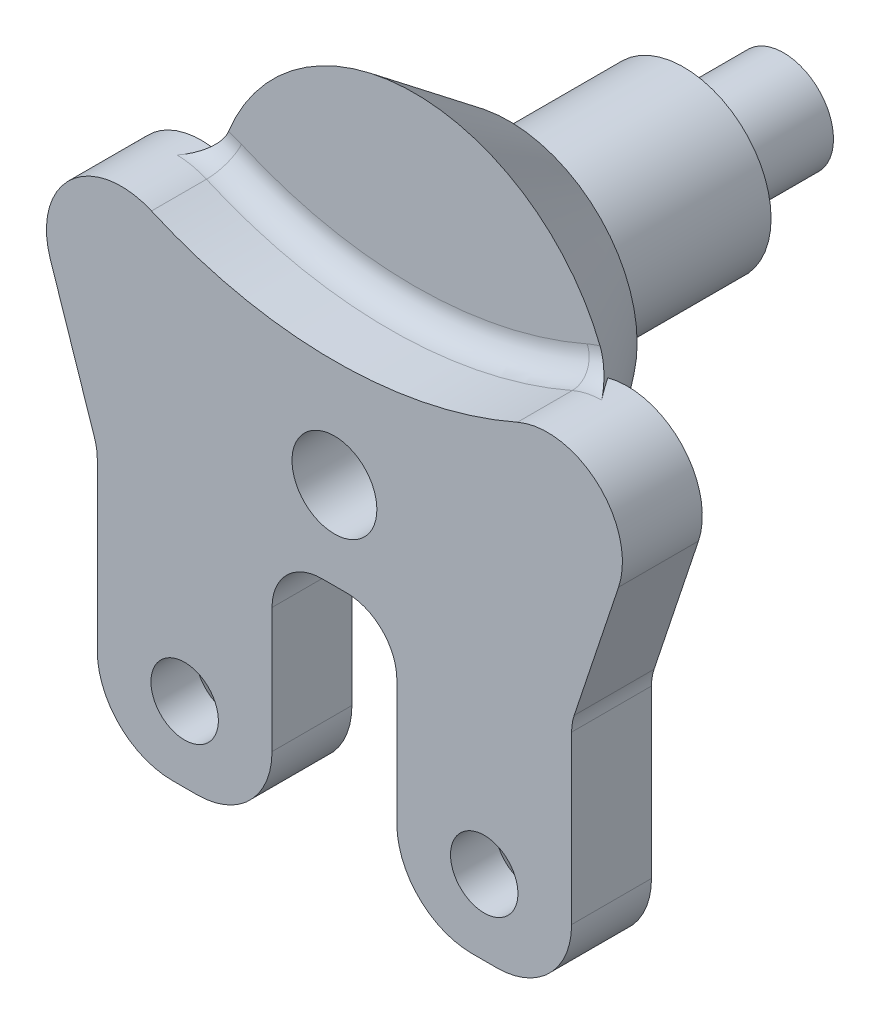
ISO-10303-21;
HEADER;
FILE_DESCRIPTION(('STEP AP214'),'2;1');
FILE_NAME('part.step','',(''),(''),'','','');
FILE_SCHEMA(('AUTOMOTIVE_DESIGN { 1 0 10303 214 1 1 1 1 }'));
ENDSEC;
DATA;
#1=APPLICATION_CONTEXT('core data for automotive mechanical design processes');
#2=APPLICATION_PROTOCOL_DEFINITION('international standard','automotive_design',2000,#1);
#3=PRODUCT_CONTEXT('',#1,'mechanical');
#4=PRODUCT('Part','Part','',(#3));
#5=PRODUCT_RELATED_PRODUCT_CATEGORY('part','',(#4));
#6=PRODUCT_DEFINITION_FORMATION('','',#4);
#7=PRODUCT_DEFINITION_CONTEXT('part definition',#1,'design');
#8=PRODUCT_DEFINITION('design','',#6,#7);
#9=PRODUCT_DEFINITION_SHAPE('','',#8);
#10=(LENGTH_UNIT() NAMED_UNIT(*) SI_UNIT(.MILLI.,.METRE.));
#11=(NAMED_UNIT(*) PLANE_ANGLE_UNIT() SI_UNIT($,.RADIAN.));
#12=(NAMED_UNIT(*) SI_UNIT($,.STERADIAN.) SOLID_ANGLE_UNIT());
#13=UNCERTAINTY_MEASURE_WITH_UNIT(LENGTH_MEASURE(1.E-05),#10,'distance_accuracy_value','');
#14=(GEOMETRIC_REPRESENTATION_CONTEXT(3) GLOBAL_UNCERTAINTY_ASSIGNED_CONTEXT((#13)) GLOBAL_UNIT_ASSIGNED_CONTEXT((#10,
#11,#12)) REPRESENTATION_CONTEXT('',''));
#15=CARTESIAN_POINT('',(0.,0.,0.));
#16=DIRECTION('',(0.,0.,1.));
#17=DIRECTION('',(1.,0.,0.));
#18=AXIS2_PLACEMENT_3D('',#15,#16,#17);
#19=CARTESIAN_POINT('',(8.53571975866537,-0.906007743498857,0.));
#20=DIRECTION('',(0.,0.,1.));
#21=DIRECTION('',(1.,0.,0.));
#22=AXIS2_PLACEMENT_3D('',#19,#20,#21);
#23=PLANE('',#22);
#24=CARTESIAN_POINT('',(0.500000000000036,-9.50000000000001,0.));
#25=DIRECTION('',(0.,0.,-1.));
#26=DIRECTION('',(-1.,0.,0.));
#27=AXIS2_PLACEMENT_3D('',#24,#25,#26);
#28=CIRCLE('',#27,2.);
#29=CARTESIAN_POINT('',(1.6100228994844,-7.83631458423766,0.));
#30=VERTEX_POINT('',#29);
#31=CARTESIAN_POINT('',(2.50000000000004,-9.50000000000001,0.));
#32=VERTEX_POINT('',#31);
#33=EDGE_CURVE('E254',#30,#32,#28,.T.);
#34=ORIENTED_EDGE('',*,*,#33,.F.);
#35=CARTESIAN_POINT('',(0.,0.,0.));
#36=DIRECTION('',(0.,0.,1.));
#37=DIRECTION('',(1.,0.,0.));
#38=AXIS2_PLACEMENT_3D('',#35,#36,#37);
#39=CIRCLE('',#38,8.);
#40=CARTESIAN_POINT('',(7.74881159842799,1.98894917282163,0.));
#41=VERTEX_POINT('',#40);
#42=EDGE_CURVE('E222',#30,#41,#39,.T.);
#43=ORIENTED_EDGE('',*,*,#42,.T.);
#44=CARTESIAN_POINT('',(8.53571975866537,-0.906007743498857,0.));
#45=DIRECTION('',(0.,0.,1.));
#46=DIRECTION('',(1.,0.,0.));
#47=AXIS2_PLACEMENT_3D('',#44,#45,#46);
#48=CIRCLE('',#47,3.);
#49=CARTESIAN_POINT('',(11.3817696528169,-1.85469104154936,0.));
#50=VERTEX_POINT('',#49);
#51=EDGE_CURVE('E229',#50,#41,#48,.T.);
#52=ORIENTED_EDGE('',*,*,#51,.F.);
#53=DIRECTION('',(0.316227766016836,0.948683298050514,0.));
#54=VECTOR('',#53,1.);
#55=CARTESIAN_POINT('',(11.3817696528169,-1.85469104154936,0.));
#56=LINE('',#55,#54);
#57=CARTESIAN_POINT('',(9.60263340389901,-7.19209978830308,0.));
#58=VERTEX_POINT('',#57);
#59=EDGE_CURVE('E270',#58,#50,#56,.T.);
#60=ORIENTED_EDGE('',*,*,#59,.F.);
#61=CARTESIAN_POINT('',(11.5,-7.82455532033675,0.));
#62=DIRECTION('',(0.,0.,-1.));
#63=DIRECTION('',(1.,0.,0.));
#64=AXIS2_PLACEMENT_3D('',#61,#62,#63);
#65=CIRCLE('',#64,2.);
#66=CARTESIAN_POINT('',(9.50000000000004,-7.82455532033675,0.));
#67=VERTEX_POINT('',#66);
#68=EDGE_CURVE('E268',#67,#58,#65,.T.);
#69=ORIENTED_EDGE('',*,*,#68,.F.);
#70=DIRECTION('',(0.,1.,0.));
#71=VECTOR('',#70,1.);
#72=CARTESIAN_POINT('',(9.50000000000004,-7.82455532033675,0.));
#73=LINE('',#72,#71);
#74=CARTESIAN_POINT('',(9.50000000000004,-14.5,0.));
#75=VERTEX_POINT('',#74);
#76=EDGE_CURVE('E266',#75,#67,#73,.T.);
#77=ORIENTED_EDGE('',*,*,#76,.F.);
#78=CARTESIAN_POINT('',(6.50000000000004,-14.5,0.));
#79=DIRECTION('',(0.,0.,1.));
#80=DIRECTION('',(-1.,0.,0.));
#81=AXIS2_PLACEMENT_3D('',#78,#79,#80);
#82=CIRCLE('',#81,3.);
#83=CARTESIAN_POINT('',(6.50000000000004,-17.5,0.));
#84=VERTEX_POINT('',#83);
#85=EDGE_CURVE('E264',#84,#75,#82,.T.);
#86=ORIENTED_EDGE('',*,*,#85,.F.);
#87=DIRECTION('',(1.,0.,0.));
#88=VECTOR('',#87,1.);
#89=CARTESIAN_POINT('',(6.50000000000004,-17.5,0.));
#90=LINE('',#89,#88);
#91=CARTESIAN_POINT('',(5.50000000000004,-17.5,0.));
#92=VERTEX_POINT('',#91);
#93=EDGE_CURVE('E262',#92,#84,#90,.T.);
#94=ORIENTED_EDGE('',*,*,#93,.F.);
#95=CARTESIAN_POINT('',(5.50000000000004,-14.5,0.));
#96=DIRECTION('',(0.,0.,1.));
#97=DIRECTION('',(-1.,0.,0.));
#98=AXIS2_PLACEMENT_3D('',#95,#96,#97);
#99=CIRCLE('',#98,3.);
#100=CARTESIAN_POINT('',(2.50000000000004,-14.5,0.));
#101=VERTEX_POINT('',#100);
#102=EDGE_CURVE('E260',#101,#92,#99,.T.);
#103=ORIENTED_EDGE('',*,*,#102,.F.);
#104=DIRECTION('',(0.,-1.,0.));
#105=VECTOR('',#104,1.);
#106=CARTESIAN_POINT('',(2.50000000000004,-9.50000000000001,0.));
#107=LINE('',#106,#105);
#108=EDGE_CURVE('E258',#32,#101,#107,.T.);
#109=ORIENTED_EDGE('',*,*,#108,.F.);
#110=EDGE_LOOP('',(#34,#43,#52,#60,#69,#77,#86,#94,#103,#109));
#111=FACE_BOUND('',#110,.T.);
#112=CARTESIAN_POINT('',(6.00000000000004,-14.5,0.));
#113=DIRECTION('',(0.,0.,-1.));
#114=DIRECTION('',(-1.,0.,0.));
#115=AXIS2_PLACEMENT_3D('',#112,#113,#114);
#116=CIRCLE('',#115,2.75);
#117=CARTESIAN_POINT('',(3.25000000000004,-14.5,0.));
#118=VERTEX_POINT('',#117);
#119=EDGE_CURVE('E666',#118,#118,#116,.T.);
#120=ORIENTED_EDGE('',*,*,#119,.F.);
#121=EDGE_LOOP('',(#120));
#122=FACE_BOUND('',#121,.T.);
#123=ADVANCED_FACE('F35',(#111,#122),#23,.F.);
#124=CARTESIAN_POINT('',(-8.53571975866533,-0.906007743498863,0.));
#125=DIRECTION('',(0.,0.,1.));
#126=DIRECTION('',(1.,0.,0.));
#127=AXIS2_PLACEMENT_3D('',#124,#125,#126);
#128=CIRCLE('',#127,3.);
#129=CARTESIAN_POINT('',(-7.74881159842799,1.98894917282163,0.));
#130=VERTEX_POINT('',#129);
#131=CARTESIAN_POINT('',(-11.3817696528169,-1.85469104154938,0.));
#132=VERTEX_POINT('',#131);
#133=EDGE_CURVE('E205',#130,#132,#128,.T.);
#134=ORIENTED_EDGE('',*,*,#133,.F.);
#135=CARTESIAN_POINT('',(-1.61002289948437,-7.83631458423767,0.));
#136=VERTEX_POINT('',#135);
#137=EDGE_CURVE('E214',#130,#136,#39,.T.);
#138=ORIENTED_EDGE('',*,*,#137,.T.);
#139=CARTESIAN_POINT('',(-0.5,-9.50000000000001,0.));
#140=DIRECTION('',(0.,0.,-1.));
#141=DIRECTION('',(1.,0.,0.));
#142=AXIS2_PLACEMENT_3D('',#139,#140,#141);
#143=CIRCLE('',#142,2.);
#144=CARTESIAN_POINT('',(-2.5,-9.50000000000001,0.));
#145=VERTEX_POINT('',#144);
#146=EDGE_CURVE('E249',#145,#136,#143,.T.);
#147=ORIENTED_EDGE('',*,*,#146,.F.);
#148=DIRECTION('',(0.,1.,0.));
#149=VECTOR('',#148,1.);
#150=CARTESIAN_POINT('',(-2.5,-9.50000000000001,0.));
#151=LINE('',#150,#149);
#152=CARTESIAN_POINT('',(-2.5,-14.5,0.));
#153=VERTEX_POINT('',#152);
#154=EDGE_CURVE('E246',#153,#145,#151,.T.);
#155=ORIENTED_EDGE('',*,*,#154,.F.);
#156=CARTESIAN_POINT('',(-5.5,-14.5,0.));
#157=DIRECTION('',(0.,0.,1.));
#158=DIRECTION('',(-1.,0.,0.));
#159=AXIS2_PLACEMENT_3D('',#156,#157,#158);
#160=CIRCLE('',#159,3.);
#161=CARTESIAN_POINT('',(-5.5,-17.5,0.));
#162=VERTEX_POINT('',#161);
#163=EDGE_CURVE('E244',#162,#153,#160,.T.);
#164=ORIENTED_EDGE('',*,*,#163,.F.);
#165=DIRECTION('',(1.,0.,0.));
#166=VECTOR('',#165,1.);
#167=CARTESIAN_POINT('',(-5.5,-17.5,0.));
#168=LINE('',#167,#166);
#169=CARTESIAN_POINT('',(-6.5,-17.5,0.));
#170=VERTEX_POINT('',#169);
#171=EDGE_CURVE('E242',#170,#162,#168,.T.);
#172=ORIENTED_EDGE('',*,*,#171,.F.);
#173=CARTESIAN_POINT('',(-6.5,-14.5,0.));
#174=DIRECTION('',(0.,0.,1.));
#175=DIRECTION('',(-1.,0.,0.));
#176=AXIS2_PLACEMENT_3D('',#173,#174,#175);
#177=CIRCLE('',#176,3.);
#178=CARTESIAN_POINT('',(-9.5,-14.5,0.));
#179=VERTEX_POINT('',#178);
#180=EDGE_CURVE('E240',#179,#170,#177,.T.);
#181=ORIENTED_EDGE('',*,*,#180,.F.);
#182=DIRECTION('',(0.,-1.,0.));
#183=VECTOR('',#182,1.);
#184=CARTESIAN_POINT('',(-9.5,-7.82455532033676,0.));
#185=LINE('',#184,#183);
#186=CARTESIAN_POINT('',(-9.5,-7.82455532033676,0.));
#187=VERTEX_POINT('',#186);
#188=EDGE_CURVE('E238',#187,#179,#185,.T.);
#189=ORIENTED_EDGE('',*,*,#188,.F.);
#190=CARTESIAN_POINT('',(-11.5,-7.82455532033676,0.));
#191=DIRECTION('',(0.,0.,-1.));
#192=DIRECTION('',(-1.,0.,0.));
#193=AXIS2_PLACEMENT_3D('',#190,#191,#192);
#194=CIRCLE('',#193,2.);
#195=CARTESIAN_POINT('',(-9.60263340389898,-7.19209978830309,0.));
#196=VERTEX_POINT('',#195);
#197=EDGE_CURVE('E231',#196,#187,#194,.T.);
#198=ORIENTED_EDGE('',*,*,#197,.F.);
#199=DIRECTION('',(0.316227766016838,-0.948683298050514,0.));
#200=VECTOR('',#199,1.);
#201=CARTESIAN_POINT('',(-11.3817696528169,-1.85469104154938,0.));
#202=LINE('',#201,#200);
#203=EDGE_CURVE('E228',#132,#196,#202,.T.);
#204=ORIENTED_EDGE('',*,*,#203,.F.);
#205=EDGE_LOOP('',(#134,#138,#147,#155,#164,#172,#181,#189,#198,#204));
#206=FACE_BOUND('',#205,.T.);
#207=CARTESIAN_POINT('',(-6.,-14.5,0.));
#208=DIRECTION('',(0.,0.,-1.));
#209=DIRECTION('',(-1.,0.,0.));
#210=AXIS2_PLACEMENT_3D('',#207,#208,#209);
#211=CIRCLE('',#210,2.75);
#212=CARTESIAN_POINT('',(-8.75,-14.5,0.));
#213=VERTEX_POINT('',#212);
#214=EDGE_CURVE('E673',#213,#213,#211,.T.);
#215=ORIENTED_EDGE('',*,*,#214,.F.);
#216=EDGE_LOOP('',(#215));
#217=FACE_BOUND('',#216,.T.);
#218=ADVANCED_FACE('F225',(#206,#217),#23,.F.);
#219=CARTESIAN_POINT('',(8.53571975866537,-0.906007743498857,3.2));
#220=DIRECTION('',(0.,0.,1.));
#221=DIRECTION('',(1.,0.,0.));
#222=AXIS2_PLACEMENT_3D('',#219,#220,#221);
#223=PLANE('',#222);
#224=CARTESIAN_POINT('',(6.00000000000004,-14.5,3.2));
#225=DIRECTION('',(0.,0.,-1.));
#226=DIRECTION('',(-1.,0.,0.));
#227=AXIS2_PLACEMENT_3D('',#224,#225,#226);
#228=CIRCLE('',#227,1.35);
#229=CARTESIAN_POINT('',(4.65000000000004,-14.5,3.2));
#230=VERTEX_POINT('',#229);
#231=EDGE_CURVE('E668',#230,#230,#228,.T.);
#232=ORIENTED_EDGE('',*,*,#231,.T.);
#233=EDGE_LOOP('',(#232));
#234=FACE_BOUND('',#233,.T.);
#235=CARTESIAN_POINT('',(8.53571975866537,-0.906007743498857,3.2));
#236=DIRECTION('',(0.,0.,1.));
#237=DIRECTION('',(1.,0.,0.));
#238=AXIS2_PLACEMENT_3D('',#235,#236,#237);
#239=CIRCLE('',#238,3.);
#240=CARTESIAN_POINT('',(11.3817696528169,-1.85469104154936,3.2));
#241=VERTEX_POINT('',#240);
#242=CARTESIAN_POINT('',(7.3278505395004,1.84008984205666,3.2));
#243=VERTEX_POINT('',#242);
#244=EDGE_CURVE('E272',#241,#243,#239,.T.);
#245=ORIENTED_EDGE('',*,*,#244,.T.);
#246=CARTESIAN_POINT('',(0.,18.5,3.2));
#247=DIRECTION('',(0.,0.,-1.));
#248=DIRECTION('',(-1.,0.,0.));
#249=AXIS2_PLACEMENT_3D('',#246,#247,#248);
#250=CIRCLE('',#249,18.2002747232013);
#251=CARTESIAN_POINT('',(-7.32785053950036,1.84008984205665,3.2));
#252=VERTEX_POINT('',#251);
#253=EDGE_CURVE('E480',#243,#252,#250,.T.);
#254=ORIENTED_EDGE('',*,*,#253,.T.);
#255=CARTESIAN_POINT('',(-8.53571975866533,-0.906007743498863,3.2));
#256=DIRECTION('',(0.,0.,1.));
#257=DIRECTION('',(1.,0.,0.));
#258=AXIS2_PLACEMENT_3D('',#255,#256,#257);
#259=CIRCLE('',#258,3.);
#260=CARTESIAN_POINT('',(-11.3817696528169,-1.85469104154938,3.2));
#261=VERTEX_POINT('',#260);
#262=EDGE_CURVE('E551',#252,#261,#259,.T.);
#263=ORIENTED_EDGE('',*,*,#262,.T.);
#264=DIRECTION('',(0.316227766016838,-0.948683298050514,0.));
#265=VECTOR('',#264,1.);
#266=CARTESIAN_POINT('',(-11.3817696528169,-1.85469104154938,3.2));
#267=LINE('',#266,#265);
#268=CARTESIAN_POINT('',(-9.60263340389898,-7.19209978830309,3.2));
#269=VERTEX_POINT('',#268);
#270=EDGE_CURVE('E555',#261,#269,#267,.T.);
#271=ORIENTED_EDGE('',*,*,#270,.T.);
#272=CARTESIAN_POINT('',(-11.5,-7.82455532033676,3.2));
#273=DIRECTION('',(0.,0.,-1.));
#274=DIRECTION('',(-1.,0.,0.));
#275=AXIS2_PLACEMENT_3D('',#272,#273,#274);
#276=CIRCLE('',#275,2.);
#277=CARTESIAN_POINT('',(-9.5,-7.82455532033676,3.2));
#278=VERTEX_POINT('',#277);
#279=EDGE_CURVE('E557',#269,#278,#276,.T.);
#280=ORIENTED_EDGE('',*,*,#279,.T.);
#281=DIRECTION('',(0.,-1.,0.));
#282=VECTOR('',#281,1.);
#283=CARTESIAN_POINT('',(-9.5,-7.82455532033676,3.2));
#284=LINE('',#283,#282);
#285=CARTESIAN_POINT('',(-9.5,-14.5,3.2));
#286=VERTEX_POINT('',#285);
#287=EDGE_CURVE('E559',#278,#286,#284,.T.);
#288=ORIENTED_EDGE('',*,*,#287,.T.);
#289=CARTESIAN_POINT('',(-6.5,-14.5,3.2));
#290=DIRECTION('',(0.,0.,1.));
#291=DIRECTION('',(-1.,0.,0.));
#292=AXIS2_PLACEMENT_3D('',#289,#290,#291);
#293=CIRCLE('',#292,3.);
#294=CARTESIAN_POINT('',(-6.5,-17.5,3.2));
#295=VERTEX_POINT('',#294);
#296=EDGE_CURVE('E561',#286,#295,#293,.T.);
#297=ORIENTED_EDGE('',*,*,#296,.T.);
#298=DIRECTION('',(1.,0.,0.));
#299=VECTOR('',#298,1.);
#300=CARTESIAN_POINT('',(-5.5,-17.5,3.2));
#301=LINE('',#300,#299);
#302=CARTESIAN_POINT('',(-5.5,-17.5,3.2));
#303=VERTEX_POINT('',#302);
#304=EDGE_CURVE('E563',#295,#303,#301,.T.);
#305=ORIENTED_EDGE('',*,*,#304,.T.);
#306=CARTESIAN_POINT('',(-5.5,-14.5,3.2));
#307=DIRECTION('',(0.,0.,1.));
#308=DIRECTION('',(-1.,0.,0.));
#309=AXIS2_PLACEMENT_3D('',#306,#307,#308);
#310=CIRCLE('',#309,3.);
#311=CARTESIAN_POINT('',(-2.5,-14.5,3.2));
#312=VERTEX_POINT('',#311);
#313=EDGE_CURVE('E565',#303,#312,#310,.T.);
#314=ORIENTED_EDGE('',*,*,#313,.T.);
#315=DIRECTION('',(0.,1.,0.));
#316=VECTOR('',#315,1.);
#317=CARTESIAN_POINT('',(-2.5,-9.50000000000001,3.2));
#318=LINE('',#317,#316);
#319=CARTESIAN_POINT('',(-2.5,-9.50000000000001,3.2));
#320=VERTEX_POINT('',#319);
#321=EDGE_CURVE('E516',#312,#320,#318,.T.);
#322=ORIENTED_EDGE('',*,*,#321,.T.);
#323=CARTESIAN_POINT('',(-0.5,-9.50000000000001,3.2));
#324=DIRECTION('',(0.,0.,-1.));
#325=DIRECTION('',(1.,0.,0.));
#326=AXIS2_PLACEMENT_3D('',#323,#324,#325);
#327=CIRCLE('',#326,2.);
#328=CARTESIAN_POINT('',(-0.5,-7.50000000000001,3.2));
#329=VERTEX_POINT('',#328);
#330=EDGE_CURVE('E512',#320,#329,#327,.T.);
#331=ORIENTED_EDGE('',*,*,#330,.T.);
#332=DIRECTION('',(1.,0.,0.));
#333=VECTOR('',#332,1.);
#334=CARTESIAN_POINT('',(0.500000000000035,-7.50000000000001,3.2));
#335=LINE('',#334,#333);
#336=CARTESIAN_POINT('',(0.500000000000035,-7.50000000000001,3.2));
#337=VERTEX_POINT('',#336);
#338=EDGE_CURVE('E508',#329,#337,#335,.T.);
#339=ORIENTED_EDGE('',*,*,#338,.T.);
#340=CARTESIAN_POINT('',(0.500000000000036,-9.50000000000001,3.2));
#341=DIRECTION('',(0.,0.,-1.));
#342=DIRECTION('',(-1.,0.,0.));
#343=AXIS2_PLACEMENT_3D('',#340,#341,#342);
#344=CIRCLE('',#343,2.);
#345=CARTESIAN_POINT('',(2.50000000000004,-9.50000000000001,3.2));
#346=VERTEX_POINT('',#345);
#347=EDGE_CURVE('E511',#337,#346,#344,.T.);
#348=ORIENTED_EDGE('',*,*,#347,.T.);
#349=DIRECTION('',(0.,-1.,0.));
#350=VECTOR('',#349,1.);
#351=CARTESIAN_POINT('',(2.50000000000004,-9.50000000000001,3.2));
#352=LINE('',#351,#350);
#353=CARTESIAN_POINT('',(2.50000000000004,-14.5,3.2));
#354=VERTEX_POINT('',#353);
#355=EDGE_CURVE('E514',#346,#354,#352,.T.);
#356=ORIENTED_EDGE('',*,*,#355,.T.);
#357=CARTESIAN_POINT('',(5.50000000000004,-14.5,3.2));
#358=DIRECTION('',(0.,0.,1.));
#359=DIRECTION('',(-1.,0.,0.));
#360=AXIS2_PLACEMENT_3D('',#357,#358,#359);
#361=CIRCLE('',#360,3.);
#362=CARTESIAN_POINT('',(5.50000000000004,-17.5,3.2));
#363=VERTEX_POINT('',#362);
#364=EDGE_CURVE('E521',#354,#363,#361,.T.);
#365=ORIENTED_EDGE('',*,*,#364,.T.);
#366=DIRECTION('',(1.,0.,0.));
#367=VECTOR('',#366,1.);
#368=CARTESIAN_POINT('',(6.50000000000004,-17.5,3.2));
#369=LINE('',#368,#367);
#370=CARTESIAN_POINT('',(6.50000000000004,-17.5,3.2));
#371=VERTEX_POINT('',#370);
#372=EDGE_CURVE('E523',#363,#371,#369,.T.);
#373=ORIENTED_EDGE('',*,*,#372,.T.);
#374=CARTESIAN_POINT('',(6.50000000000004,-14.5,3.2));
#375=DIRECTION('',(0.,0.,1.));
#376=DIRECTION('',(-1.,0.,0.));
#377=AXIS2_PLACEMENT_3D('',#374,#375,#376);
#378=CIRCLE('',#377,3.);
#379=CARTESIAN_POINT('',(9.50000000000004,-14.5,3.2));
#380=VERTEX_POINT('',#379);
#381=EDGE_CURVE('E525',#371,#380,#378,.T.);
#382=ORIENTED_EDGE('',*,*,#381,.T.);
#383=DIRECTION('',(0.,1.,0.));
#384=VECTOR('',#383,1.);
#385=CARTESIAN_POINT('',(9.50000000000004,-7.82455532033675,3.2));
#386=LINE('',#385,#384);
#387=CARTESIAN_POINT('',(9.50000000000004,-7.82455532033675,3.2));
#388=VERTEX_POINT('',#387);
#389=EDGE_CURVE('E527',#380,#388,#386,.T.);
#390=ORIENTED_EDGE('',*,*,#389,.T.);
#391=CARTESIAN_POINT('',(11.5,-7.82455532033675,3.2));
#392=DIRECTION('',(0.,0.,-1.));
#393=DIRECTION('',(1.,0.,0.));
#394=AXIS2_PLACEMENT_3D('',#391,#392,#393);
#395=CIRCLE('',#394,2.);
#396=CARTESIAN_POINT('',(9.60263340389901,-7.19209978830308,3.2));
#397=VERTEX_POINT('',#396);
#398=EDGE_CURVE('E529',#388,#397,#395,.T.);
#399=ORIENTED_EDGE('',*,*,#398,.T.);
#400=DIRECTION('',(0.316227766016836,0.948683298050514,0.));
#401=VECTOR('',#400,1.);
#402=CARTESIAN_POINT('',(11.3817696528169,-1.85469104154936,3.2));
#403=LINE('',#402,#401);
#404=EDGE_CURVE('E277',#397,#241,#403,.T.);
#405=ORIENTED_EDGE('',*,*,#404,.T.);
#406=EDGE_LOOP('',(#245,#254,#263,#271,#280,#288,#297,#305,#314,#322,#331,#339,#348,#356,#365,
#373,#382,#390,#399,#405));
#407=FACE_BOUND('',#406,.T.);
#408=CARTESIAN_POINT('',(-2.77000644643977E-13,-4.,3.2));
#409=DIRECTION('',(0.,0.,1.));
#410=DIRECTION('',(1.,0.,0.));
#411=AXIS2_PLACEMENT_3D('',#408,#409,#410);
#412=CIRCLE('',#411,1.7);
#413=CARTESIAN_POINT('',(1.69999999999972,-4.,3.2));
#414=VERTEX_POINT('',#413);
#415=EDGE_CURVE('E594',#414,#414,#412,.T.);
#416=ORIENTED_EDGE('',*,*,#415,.F.);
#417=EDGE_LOOP('',(#416));
#418=FACE_BOUND('',#417,.T.);
#419=CARTESIAN_POINT('',(-6.,-14.5,3.2));
#420=DIRECTION('',(0.,0.,-1.));
#421=DIRECTION('',(-1.,0.,0.));
#422=AXIS2_PLACEMENT_3D('',#419,#420,#421);
#423=CIRCLE('',#422,1.35);
#424=CARTESIAN_POINT('',(-7.35,-14.5,3.2));
#425=VERTEX_POINT('',#424);
#426=EDGE_CURVE('E599',#425,#425,#423,.T.);
#427=ORIENTED_EDGE('',*,*,#426,.T.);
#428=EDGE_LOOP('',(#427));
#429=FACE_BOUND('',#428,.T.);
#430=ADVANCED_FACE('F397',(#234,#407,#418,#429),#223,.T.);
#431=CARTESIAN_POINT('',(8.53571975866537,-0.906007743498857,3.2));
#432=DIRECTION('',(0.,0.,-1.));
#433=DIRECTION('',(-1.,0.,0.));
#434=AXIS2_PLACEMENT_3D('',#431,#432,#433);
#435=CYLINDRICAL_SURFACE('',#434,3.);
#436=CARTESIAN_POINT('',(7.74881159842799,1.98894917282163,0.));
#437=CARTESIAN_POINT('',(7.80983878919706,2.00553371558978,0.0836538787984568));
#438=CARTESIAN_POINT('',(7.87137504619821,2.02019210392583,0.167319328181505));
#439=CARTESIAN_POINT('',(7.9952782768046,2.04558878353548,0.334433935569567));
#440=CARTESIAN_POINT('',(8.05764387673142,2.05633288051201,0.417883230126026));
#441=CARTESIAN_POINT('',(8.18320129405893,2.07388295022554,0.584576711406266));
#442=CARTESIAN_POINT('',(8.24639311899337,2.08068888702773,0.667820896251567));
#443=CARTESIAN_POINT('',(8.37358955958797,2.0902870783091,0.834115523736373));
#444=CARTESIAN_POINT('',(8.4375952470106,2.09307333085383,0.917165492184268));
#445=CARTESIAN_POINT('',(8.50190693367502,2.09380169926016,1.));
#446=B_SPLINE_CURVE_WITH_KNOTS('',3,(#436,#437,#438,#439,#440,#441,#442,#443,#444,#445),
.UNSPECIFIED.,.F.,.F.,(4,2,2,2,4),(0.,0.314586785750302,0.628705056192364,0.94282619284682,
1.25741587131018),.UNSPECIFIED.);
#447=CARTESIAN_POINT('',(8.50190693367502,2.09380169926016,1.));
#448=VERTEX_POINT('',#447);
#449=EDGE_CURVE('E53',#41,#448,#446,.T.);
#450=ORIENTED_EDGE('',*,*,#449,.T.);
#451=CARTESIAN_POINT('',(8.53571975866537,-0.906007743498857,1.));
#452=DIRECTION('',(0.,0.,1.));
#453=DIRECTION('',(1.,0.,0.));
#454=AXIS2_PLACEMENT_3D('',#451,#452,#453);
#455=CIRCLE('',#454,3.);
#456=CARTESIAN_POINT('',(7.3278505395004,1.84008984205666,1.));
#457=VERTEX_POINT('',#456);
#458=EDGE_CURVE('E339',#448,#457,#455,.T.);
#459=ORIENTED_EDGE('',*,*,#458,.T.);
#460=DIRECTION('',(0.,0.,-1.));
#461=VECTOR('',#460,1.);
#462=CARTESIAN_POINT('',(7.3278505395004,1.84008984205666,3.2));
#463=LINE('',#462,#461);
#464=EDGE_CURVE('E329',#243,#457,#463,.T.);
#465=ORIENTED_EDGE('',*,*,#464,.F.);
#466=ORIENTED_EDGE('',*,*,#244,.F.);
#467=DIRECTION('',(0.,0.,-1.));
#468=VECTOR('',#467,1.);
#469=CARTESIAN_POINT('',(11.3817696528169,-1.85469104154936,3.2));
#470=LINE('',#469,#468);
#471=EDGE_CURVE('E273',#241,#50,#470,.T.);
#472=ORIENTED_EDGE('',*,*,#471,.T.);
#473=ORIENTED_EDGE('',*,*,#51,.T.);
#474=EDGE_LOOP('',(#450,#459,#465,#466,#472,#473));
#475=FACE_BOUND('',#474,.T.);
#476=ADVANCED_FACE('F341',(#475),#435,.T.);
#477=CARTESIAN_POINT('',(0.,18.5,3.2));
#478=DIRECTION('',(0.,0.,-1.));
#479=DIRECTION('',(-1.,0.,0.));
#480=AXIS2_PLACEMENT_3D('',#477,#478,#479);
#481=CYLINDRICAL_SURFACE('',#480,18.2002747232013);
#482=ORIENTED_EDGE('',*,*,#464,.T.);
#483=CARTESIAN_POINT('',(0.,18.5,1.));
#484=DIRECTION('',(0.,0.,1.));
#485=DIRECTION('',(1.,0.,0.));
#486=AXIS2_PLACEMENT_3D('',#483,#484,#485);
#487=CIRCLE('',#486,18.2002747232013);
#488=CARTESIAN_POINT('',(-7.32785053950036,1.84008984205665,1.));
#489=VERTEX_POINT('',#488);
#490=EDGE_CURVE('E371',#457,#489,#487,.F.);
#491=ORIENTED_EDGE('',*,*,#490,.T.);
#492=DIRECTION('',(0.,0.,-1.));
#493=VECTOR('',#492,1.);
#494=CARTESIAN_POINT('',(-7.32785053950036,1.84008984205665,3.2));
#495=LINE('',#494,#493);
#496=EDGE_CURVE('E327',#252,#489,#495,.T.);
#497=ORIENTED_EDGE('',*,*,#496,.F.);
#498=ORIENTED_EDGE('',*,*,#253,.F.);
#499=EDGE_LOOP('',(#482,#491,#497,#498));
#500=FACE_BOUND('',#499,.T.);
#501=ADVANCED_FACE('F470',(#500),#481,.F.);
#502=CARTESIAN_POINT('',(-8.53571975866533,-0.906007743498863,3.2));
#503=DIRECTION('',(0.,0.,-1.));
#504=DIRECTION('',(-1.,0.,0.));
#505=AXIS2_PLACEMENT_3D('',#502,#503,#504);
#506=CYLINDRICAL_SURFACE('',#505,3.);
#507=ORIENTED_EDGE('',*,*,#496,.T.);
#508=CARTESIAN_POINT('',(-8.53571975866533,-0.906007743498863,1.));
#509=DIRECTION('',(0.,0.,1.));
#510=DIRECTION('',(1.,0.,0.));
#511=AXIS2_PLACEMENT_3D('',#508,#509,#510);
#512=CIRCLE('',#511,3.);
#513=CARTESIAN_POINT('',(-8.50190693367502,2.09380169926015,1.));
#514=VERTEX_POINT('',#513);
#515=EDGE_CURVE('E208',#489,#514,#512,.T.);
#516=ORIENTED_EDGE('',*,*,#515,.T.);
#517=CARTESIAN_POINT('',(-8.50190693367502,2.09380169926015,1.));
#518=CARTESIAN_POINT('',(-8.4375952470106,2.09307333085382,0.917165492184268));
#519=CARTESIAN_POINT('',(-8.37358955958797,2.0902870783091,0.834115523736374));
#520=CARTESIAN_POINT('',(-8.24639311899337,2.08068888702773,0.667820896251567));
#521=CARTESIAN_POINT('',(-8.18320129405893,2.07388295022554,0.584576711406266));
#522=CARTESIAN_POINT('',(-8.05764387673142,2.05633288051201,0.417883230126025));
#523=CARTESIAN_POINT('',(-7.9952782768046,2.04558878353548,0.334433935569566));
#524=CARTESIAN_POINT('',(-7.8713750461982,2.02019210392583,0.167319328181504));
#525=CARTESIAN_POINT('',(-7.80983878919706,2.00553371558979,0.0836538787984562));
#526=CARTESIAN_POINT('',(-7.74881159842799,1.98894917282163,0.));
#527=B_SPLINE_CURVE_WITH_KNOTS('',3,(#517,#518,#519,#520,#521,#522,#523,#524,#525,#526),
.UNSPECIFIED.,.F.,.F.,(4,2,2,2,4),(0.,0.314589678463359,0.628710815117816,0.942829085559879,
1.25741587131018),.UNSPECIFIED.);
#528=EDGE_CURVE('E59',#514,#130,#527,.T.);
#529=ORIENTED_EDGE('',*,*,#528,.T.);
#530=ORIENTED_EDGE('',*,*,#133,.T.);
#531=DIRECTION('',(0.,0.,-1.));
#532=VECTOR('',#531,1.);
#533=CARTESIAN_POINT('',(-11.3817696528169,-1.85469104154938,3.2));
#534=LINE('',#533,#532);
#535=EDGE_CURVE('E325',#261,#132,#534,.T.);
#536=ORIENTED_EDGE('',*,*,#535,.F.);
#537=ORIENTED_EDGE('',*,*,#262,.F.);
#538=EDGE_LOOP('',(#507,#516,#529,#530,#536,#537));
#539=FACE_BOUND('',#538,.T.);
#540=ADVANCED_FACE('F202',(#539),#506,.T.);
#541=CARTESIAN_POINT('',(-11.3817696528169,-1.85469104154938,3.2));
#542=DIRECTION('',(0.948683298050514,0.316227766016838,0.));
#543=DIRECTION('',(-0.316227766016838,0.948683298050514,0.));
#544=AXIS2_PLACEMENT_3D('',#541,#542,#543);
#545=PLANE('',#544);
#546=ORIENTED_EDGE('',*,*,#203,.T.);
#547=DIRECTION('',(0.,0.,-1.));
#548=VECTOR('',#547,1.);
#549=CARTESIAN_POINT('',(-9.60263340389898,-7.19209978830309,3.2));
#550=LINE('',#549,#548);
#551=EDGE_CURVE('E322',#269,#196,#550,.T.);
#552=ORIENTED_EDGE('',*,*,#551,.F.);
#553=ORIENTED_EDGE('',*,*,#270,.F.);
#554=ORIENTED_EDGE('',*,*,#535,.T.);
#555=EDGE_LOOP('',(#546,#552,#553,#554));
#556=FACE_BOUND('',#555,.T.);
#557=ADVANCED_FACE('F464',(#556),#545,.F.);
#558=CARTESIAN_POINT('',(-11.5,-7.82455532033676,3.2));
#559=DIRECTION('',(0.,0.,-1.));
#560=DIRECTION('',(-1.,0.,0.));
#561=AXIS2_PLACEMENT_3D('',#558,#559,#560);
#562=CYLINDRICAL_SURFACE('',#561,2.);
#563=ORIENTED_EDGE('',*,*,#197,.T.);
#564=DIRECTION('',(0.,0.,-1.));
#565=VECTOR('',#564,1.);
#566=CARTESIAN_POINT('',(-9.5,-7.82455532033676,3.2));
#567=LINE('',#566,#565);
#568=EDGE_CURVE('E319',#278,#187,#567,.T.);
#569=ORIENTED_EDGE('',*,*,#568,.F.);
#570=ORIENTED_EDGE('',*,*,#279,.F.);
#571=ORIENTED_EDGE('',*,*,#551,.T.);
#572=EDGE_LOOP('',(#563,#569,#570,#571));
#573=FACE_BOUND('',#572,.T.);
#574=ADVANCED_FACE('F460',(#573),#562,.F.);
#575=CARTESIAN_POINT('',(-9.5,-7.82455532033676,3.2));
#576=DIRECTION('',(1.,0.,0.));
#577=DIRECTION('',(0.,1.,0.));
#578=AXIS2_PLACEMENT_3D('',#575,#576,#577);
#579=PLANE('',#578);
#580=ORIENTED_EDGE('',*,*,#188,.T.);
#581=DIRECTION('',(0.,0.,-1.));
#582=VECTOR('',#581,1.);
#583=CARTESIAN_POINT('',(-9.5,-14.5,3.2));
#584=LINE('',#583,#582);
#585=EDGE_CURVE('E316',#286,#179,#584,.T.);
#586=ORIENTED_EDGE('',*,*,#585,.F.);
#587=ORIENTED_EDGE('',*,*,#287,.F.);
#588=ORIENTED_EDGE('',*,*,#568,.T.);
#589=EDGE_LOOP('',(#580,#586,#587,#588));
#590=FACE_BOUND('',#589,.T.);
#591=ADVANCED_FACE('F456',(#590),#579,.F.);
#592=CARTESIAN_POINT('',(-6.5,-14.5,3.2));
#593=DIRECTION('',(0.,0.,-1.));
#594=DIRECTION('',(-1.,0.,0.));
#595=AXIS2_PLACEMENT_3D('',#592,#593,#594);
#596=CYLINDRICAL_SURFACE('',#595,3.);
#597=ORIENTED_EDGE('',*,*,#180,.T.);
#598=DIRECTION('',(0.,0.,-1.));
#599=VECTOR('',#598,1.);
#600=CARTESIAN_POINT('',(-6.5,-17.5,3.2));
#601=LINE('',#600,#599);
#602=EDGE_CURVE('E313',#295,#170,#601,.T.);
#603=ORIENTED_EDGE('',*,*,#602,.F.);
#604=ORIENTED_EDGE('',*,*,#296,.F.);
#605=ORIENTED_EDGE('',*,*,#585,.T.);
#606=EDGE_LOOP('',(#597,#603,#604,#605));
#607=FACE_BOUND('',#606,.T.);
#608=ADVANCED_FACE('F452',(#607),#596,.T.);
#609=CARTESIAN_POINT('',(-5.5,-17.5,3.2));
#610=DIRECTION('',(0.,1.,0.));
#611=DIRECTION('',(0.,0.,1.));
#612=AXIS2_PLACEMENT_3D('',#609,#610,#611);
#613=PLANE('',#612);
#614=ORIENTED_EDGE('',*,*,#171,.T.);
#615=DIRECTION('',(0.,0.,-1.));
#616=VECTOR('',#615,1.);
#617=CARTESIAN_POINT('',(-5.5,-17.5,3.2));
#618=LINE('',#617,#616);
#619=EDGE_CURVE('E310',#303,#162,#618,.T.);
#620=ORIENTED_EDGE('',*,*,#619,.F.);
#621=ORIENTED_EDGE('',*,*,#304,.F.);
#622=ORIENTED_EDGE('',*,*,#602,.T.);
#623=EDGE_LOOP('',(#614,#620,#621,#622));
#624=FACE_BOUND('',#623,.T.);
#625=ADVANCED_FACE('F448',(#624),#613,.F.);
#626=CARTESIAN_POINT('',(-5.5,-14.5,3.2));
#627=DIRECTION('',(0.,0.,-1.));
#628=DIRECTION('',(-1.,0.,0.));
#629=AXIS2_PLACEMENT_3D('',#626,#627,#628);
#630=CYLINDRICAL_SURFACE('',#629,3.);
#631=ORIENTED_EDGE('',*,*,#163,.T.);
#632=DIRECTION('',(0.,0.,-1.));
#633=VECTOR('',#632,1.);
#634=CARTESIAN_POINT('',(-2.5,-14.5,3.2));
#635=LINE('',#634,#633);
#636=EDGE_CURVE('E307',#312,#153,#635,.T.);
#637=ORIENTED_EDGE('',*,*,#636,.F.);
#638=ORIENTED_EDGE('',*,*,#313,.F.);
#639=ORIENTED_EDGE('',*,*,#619,.T.);
#640=EDGE_LOOP('',(#631,#637,#638,#639));
#641=FACE_BOUND('',#640,.T.);
#642=ADVANCED_FACE('F444',(#641),#630,.T.);
#643=CARTESIAN_POINT('',(-2.5,-9.50000000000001,3.2));
#644=DIRECTION('',(-1.,0.,0.));
#645=DIRECTION('',(0.,-1.,0.));
#646=AXIS2_PLACEMENT_3D('',#643,#644,#645);
#647=PLANE('',#646);
#648=ORIENTED_EDGE('',*,*,#154,.T.);
#649=DIRECTION('',(0.,0.,-1.));
#650=VECTOR('',#649,1.);
#651=CARTESIAN_POINT('',(-2.5,-9.50000000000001,3.2));
#652=LINE('',#651,#650);
#653=EDGE_CURVE('E304',#320,#145,#652,.T.);
#654=ORIENTED_EDGE('',*,*,#653,.F.);
#655=ORIENTED_EDGE('',*,*,#321,.F.);
#656=ORIENTED_EDGE('',*,*,#636,.T.);
#657=EDGE_LOOP('',(#648,#654,#655,#656));
#658=FACE_BOUND('',#657,.T.);
#659=ADVANCED_FACE('F440',(#658),#647,.F.);
#660=CARTESIAN_POINT('',(-0.5,-9.50000000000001,3.2));
#661=DIRECTION('',(0.,0.,-1.));
#662=DIRECTION('',(-1.,0.,0.));
#663=AXIS2_PLACEMENT_3D('',#660,#661,#662);
#664=CYLINDRICAL_SURFACE('',#663,2.);
#665=ORIENTED_EDGE('',*,*,#146,.T.);
#666=CARTESIAN_POINT('',(-0.5,-7.50000000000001,0.));
#667=VERTEX_POINT('',#666);
#668=EDGE_CURVE('E248',#136,#667,#143,.T.);
#669=ORIENTED_EDGE('',*,*,#668,.T.);
#670=DIRECTION('',(0.,0.,-1.));
#671=VECTOR('',#670,1.);
#672=CARTESIAN_POINT('',(-0.5,-7.50000000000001,3.2));
#673=LINE('',#672,#671);
#674=EDGE_CURVE('E301',#329,#667,#673,.T.);
#675=ORIENTED_EDGE('',*,*,#674,.F.);
#676=ORIENTED_EDGE('',*,*,#330,.F.);
#677=ORIENTED_EDGE('',*,*,#653,.T.);
#678=EDGE_LOOP('',(#665,#669,#675,#676,#677));
#679=FACE_BOUND('',#678,.T.);
#680=ADVANCED_FACE('F436',(#679),#664,.F.);
#681=CARTESIAN_POINT('',(0.500000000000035,-7.50000000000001,3.2));
#682=DIRECTION('',(0.,1.,0.));
#683=DIRECTION('',(0.,0.,1.));
#684=AXIS2_PLACEMENT_3D('',#681,#682,#683);
#685=PLANE('',#684);
#686=DIRECTION('',(1.,0.,0.));
#687=VECTOR('',#686,1.);
#688=CARTESIAN_POINT('',(0.500000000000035,-7.50000000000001,0.));
#689=LINE('',#688,#687);
#690=CARTESIAN_POINT('',(0.500000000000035,-7.50000000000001,0.));
#691=VERTEX_POINT('',#690);
#692=EDGE_CURVE('E251',#667,#691,#689,.T.);
#693=ORIENTED_EDGE('',*,*,#692,.T.);
#694=DIRECTION('',(0.,0.,-1.));
#695=VECTOR('',#694,1.);
#696=CARTESIAN_POINT('',(0.500000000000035,-7.50000000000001,3.2));
#697=LINE('',#696,#695);
#698=EDGE_CURVE('E298',#337,#691,#697,.T.);
#699=ORIENTED_EDGE('',*,*,#698,.F.);
#700=ORIENTED_EDGE('',*,*,#338,.F.);
#701=ORIENTED_EDGE('',*,*,#674,.T.);
#702=EDGE_LOOP('',(#693,#699,#700,#701));
#703=FACE_BOUND('',#702,.T.);
#704=ADVANCED_FACE('F432',(#703),#685,.F.);
#705=CARTESIAN_POINT('',(0.500000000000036,-9.50000000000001,3.2));
#706=DIRECTION('',(0.,0.,-1.));
#707=DIRECTION('',(-1.,0.,0.));
#708=AXIS2_PLACEMENT_3D('',#705,#706,#707);
#709=CYLINDRICAL_SURFACE('',#708,2.);
#710=EDGE_CURVE('E255',#691,#30,#28,.T.);
#711=ORIENTED_EDGE('',*,*,#710,.T.);
#712=ORIENTED_EDGE('',*,*,#33,.T.);
#713=DIRECTION('',(0.,0.,-1.));
#714=VECTOR('',#713,1.);
#715=CARTESIAN_POINT('',(2.50000000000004,-9.50000000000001,3.2));
#716=LINE('',#715,#714);
#717=EDGE_CURVE('E295',#346,#32,#716,.T.);
#718=ORIENTED_EDGE('',*,*,#717,.F.);
#719=ORIENTED_EDGE('',*,*,#347,.F.);
#720=ORIENTED_EDGE('',*,*,#698,.T.);
#721=EDGE_LOOP('',(#711,#712,#718,#719,#720));
#722=FACE_BOUND('',#721,.T.);
#723=ADVANCED_FACE('F428',(#722),#709,.F.);
#724=CARTESIAN_POINT('',(2.50000000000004,-9.50000000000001,3.2));
#725=DIRECTION('',(1.,0.,0.));
#726=DIRECTION('',(0.,1.,0.));
#727=AXIS2_PLACEMENT_3D('',#724,#725,#726);
#728=PLANE('',#727);
#729=ORIENTED_EDGE('',*,*,#108,.T.);
#730=DIRECTION('',(0.,0.,-1.));
#731=VECTOR('',#730,1.);
#732=CARTESIAN_POINT('',(2.50000000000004,-14.5,3.2));
#733=LINE('',#732,#731);
#734=EDGE_CURVE('E292',#354,#101,#733,.T.);
#735=ORIENTED_EDGE('',*,*,#734,.F.);
#736=ORIENTED_EDGE('',*,*,#355,.F.);
#737=ORIENTED_EDGE('',*,*,#717,.T.);
#738=EDGE_LOOP('',(#729,#735,#736,#737));
#739=FACE_BOUND('',#738,.T.);
#740=ADVANCED_FACE('F424',(#739),#728,.F.);
#741=CARTESIAN_POINT('',(5.50000000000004,-14.5,3.2));
#742=DIRECTION('',(0.,0.,-1.));
#743=DIRECTION('',(-1.,0.,0.));
#744=AXIS2_PLACEMENT_3D('',#741,#742,#743);
#745=CYLINDRICAL_SURFACE('',#744,3.);
#746=ORIENTED_EDGE('',*,*,#102,.T.);
#747=DIRECTION('',(0.,0.,-1.));
#748=VECTOR('',#747,1.);
#749=CARTESIAN_POINT('',(5.50000000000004,-17.5,3.2));
#750=LINE('',#749,#748);
#751=EDGE_CURVE('E289',#363,#92,#750,.T.);
#752=ORIENTED_EDGE('',*,*,#751,.F.);
#753=ORIENTED_EDGE('',*,*,#364,.F.);
#754=ORIENTED_EDGE('',*,*,#734,.T.);
#755=EDGE_LOOP('',(#746,#752,#753,#754));
#756=FACE_BOUND('',#755,.T.);
#757=ADVANCED_FACE('F420',(#756),#745,.T.);
#758=CARTESIAN_POINT('',(6.50000000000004,-17.5,3.2));
#759=DIRECTION('',(0.,1.,0.));
#760=DIRECTION('',(0.,0.,1.));
#761=AXIS2_PLACEMENT_3D('',#758,#759,#760);
#762=PLANE('',#761);
#763=ORIENTED_EDGE('',*,*,#93,.T.);
#764=DIRECTION('',(0.,0.,-1.));
#765=VECTOR('',#764,1.);
#766=CARTESIAN_POINT('',(6.50000000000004,-17.5,3.2));
#767=LINE('',#766,#765);
#768=EDGE_CURVE('E286',#371,#84,#767,.T.);
#769=ORIENTED_EDGE('',*,*,#768,.F.);
#770=ORIENTED_EDGE('',*,*,#372,.F.);
#771=ORIENTED_EDGE('',*,*,#751,.T.);
#772=EDGE_LOOP('',(#763,#769,#770,#771));
#773=FACE_BOUND('',#772,.T.);
#774=ADVANCED_FACE('F416',(#773),#762,.F.);
#775=CARTESIAN_POINT('',(6.50000000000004,-14.5,3.2));
#776=DIRECTION('',(0.,0.,-1.));
#777=DIRECTION('',(-1.,0.,0.));
#778=AXIS2_PLACEMENT_3D('',#775,#776,#777);
#779=CYLINDRICAL_SURFACE('',#778,3.);
#780=ORIENTED_EDGE('',*,*,#85,.T.);
#781=DIRECTION('',(0.,0.,-1.));
#782=VECTOR('',#781,1.);
#783=CARTESIAN_POINT('',(9.50000000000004,-14.5,3.2));
#784=LINE('',#783,#782);
#785=EDGE_CURVE('E283',#380,#75,#784,.T.);
#786=ORIENTED_EDGE('',*,*,#785,.F.);
#787=ORIENTED_EDGE('',*,*,#381,.F.);
#788=ORIENTED_EDGE('',*,*,#768,.T.);
#789=EDGE_LOOP('',(#780,#786,#787,#788));
#790=FACE_BOUND('',#789,.T.);
#791=ADVANCED_FACE('F412',(#790),#779,.T.);
#792=CARTESIAN_POINT('',(9.50000000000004,-7.82455532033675,3.2));
#793=DIRECTION('',(-1.,0.,0.));
#794=DIRECTION('',(0.,0.,1.));
#795=AXIS2_PLACEMENT_3D('',#792,#793,#794);
#796=PLANE('',#795);
#797=ORIENTED_EDGE('',*,*,#76,.T.);
#798=DIRECTION('',(0.,0.,-1.));
#799=VECTOR('',#798,1.);
#800=CARTESIAN_POINT('',(9.50000000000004,-7.82455532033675,3.2));
#801=LINE('',#800,#799);
#802=EDGE_CURVE('E280',#388,#67,#801,.T.);
#803=ORIENTED_EDGE('',*,*,#802,.F.);
#804=ORIENTED_EDGE('',*,*,#389,.F.);
#805=ORIENTED_EDGE('',*,*,#785,.T.);
#806=EDGE_LOOP('',(#797,#803,#804,#805));
#807=FACE_BOUND('',#806,.T.);
#808=ADVANCED_FACE('F408',(#807),#796,.F.);
#809=CARTESIAN_POINT('',(11.5,-7.82455532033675,3.2));
#810=DIRECTION('',(0.,0.,-1.));
#811=DIRECTION('',(-1.,0.,0.));
#812=AXIS2_PLACEMENT_3D('',#809,#810,#811);
#813=CYLINDRICAL_SURFACE('',#812,2.);
#814=ORIENTED_EDGE('',*,*,#68,.T.);
#815=DIRECTION('',(0.,0.,-1.));
#816=VECTOR('',#815,1.);
#817=CARTESIAN_POINT('',(9.60263340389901,-7.19209978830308,3.2));
#818=LINE('',#817,#816);
#819=EDGE_CURVE('E276',#397,#58,#818,.T.);
#820=ORIENTED_EDGE('',*,*,#819,.F.);
#821=ORIENTED_EDGE('',*,*,#398,.F.);
#822=ORIENTED_EDGE('',*,*,#802,.T.);
#823=EDGE_LOOP('',(#814,#820,#821,#822));
#824=FACE_BOUND('',#823,.T.);
#825=ADVANCED_FACE('F404',(#824),#813,.F.);
#826=CARTESIAN_POINT('',(11.3817696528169,-1.85469104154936,3.2));
#827=DIRECTION('',(-0.948683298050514,0.316227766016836,0.));
#828=DIRECTION('',(-0.316227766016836,-0.948683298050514,0.));
#829=AXIS2_PLACEMENT_3D('',#826,#827,#828);
#830=PLANE('',#829);
#831=ORIENTED_EDGE('',*,*,#59,.T.);
#832=ORIENTED_EDGE('',*,*,#471,.F.);
#833=ORIENTED_EDGE('',*,*,#404,.F.);
#834=ORIENTED_EDGE('',*,*,#819,.T.);
#835=EDGE_LOOP('',(#831,#832,#833,#834));
#836=FACE_BOUND('',#835,.T.);
#837=ADVANCED_FACE('F401',(#836),#830,.F.);
#838=CARTESIAN_POINT('',(0.,0.,0.));
#839=DIRECTION('',(0.,0.,1.));
#840=DIRECTION('',(1.,0.,0.));
#841=AXIS2_PLACEMENT_3D('',#838,#839,#840);
#842=PLANE('',#841);
#843=ORIENTED_EDGE('',*,*,#710,.F.);
#844=ORIENTED_EDGE('',*,*,#692,.F.);
#845=ORIENTED_EDGE('',*,*,#668,.F.);
#846=EDGE_CURVE('E218',#136,#30,#39,.T.);
#847=ORIENTED_EDGE('',*,*,#846,.T.);
#848=EDGE_LOOP('',(#843,#844,#845,#847));
#849=FACE_BOUND('',#848,.T.);
#850=ADVANCED_FACE('F353',(#849),#842,.T.);
#851=CARTESIAN_POINT('',(0.,18.5,0.));
#852=DIRECTION('',(0.,0.,1.));
#853=DIRECTION('',(1.,0.,0.));
#854=AXIS2_PLACEMENT_3D('',#851,#852,#853);
#855=CIRCLE('',#854,17.2002747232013);
#856=CARTESIAN_POINT('',(-6.92522746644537,2.75545570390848,0.));
#857=VERTEX_POINT('',#856);
#858=CARTESIAN_POINT('',(6.92522746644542,2.7554557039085,0.));
#859=VERTEX_POINT('',#858);
#860=EDGE_CURVE('E486',#857,#859,#855,.T.);
#861=ORIENTED_EDGE('',*,*,#860,.T.);
#862=CARTESIAN_POINT('',(8.53571975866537,-0.906007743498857,0.));
#863=DIRECTION('',(0.,0.,1.));
#864=DIRECTION('',(1.,0.,0.));
#865=AXIS2_PLACEMENT_3D('',#862,#863,#864);
#866=CIRCLE('',#865,4.);
#867=CARTESIAN_POINT('',(7.43981714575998,2.94093876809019,0.));
#868=VERTEX_POINT('',#867);
#869=EDGE_CURVE('E210',#859,#868,#866,.F.);
#870=ORIENTED_EDGE('',*,*,#869,.T.);
#871=CARTESIAN_POINT('',(-7.43981714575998,2.94093876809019,0.));
#872=VERTEX_POINT('',#871);
#873=EDGE_CURVE('E233',#868,#872,#39,.T.);
#874=ORIENTED_EDGE('',*,*,#873,.T.);
#875=CARTESIAN_POINT('',(-8.53571975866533,-0.906007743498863,0.));
#876=DIRECTION('',(0.,0.,1.));
#877=DIRECTION('',(1.,0.,0.));
#878=AXIS2_PLACEMENT_3D('',#875,#876,#877);
#879=CIRCLE('',#878,4.);
#880=EDGE_CURVE('E487',#872,#857,#879,.F.);
#881=ORIENTED_EDGE('',*,*,#880,.T.);
#882=EDGE_LOOP('',(#861,#870,#874,#881));
#883=FACE_BOUND('',#882,.T.);
#884=ADVANCED_FACE('F350',(#883),#842,.T.);
#885=CARTESIAN_POINT('',(0.,0.,0.));
#886=DIRECTION('',(0.,0.,1.));
#887=DIRECTION('',(1.,0.,0.));
#888=AXIS2_PLACEMENT_3D('',#885,#886,#887);
#889=CONICAL_SURFACE('',#888,8.,0.647289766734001);
#890=CARTESIAN_POINT('',(0.,0.,-3.79));
#891=DIRECTION('',(0.,0.,1.));
#892=DIRECTION('',(1.,0.,0.));
#893=AXIS2_PLACEMENT_3D('',#890,#891,#892);
#894=CIRCLE('',#893,5.135);
#895=CARTESIAN_POINT('',(5.135,0.,-3.79));
#896=VERTEX_POINT('',#895);
#897=EDGE_CURVE('E495',#896,#896,#894,.T.);
#898=ORIENTED_EDGE('',*,*,#897,.T.);
#899=EDGE_LOOP('',(#898));
#900=FACE_BOUND('',#899,.T.);
#901=ORIENTED_EDGE('',*,*,#873,.F.);
#902=CARTESIAN_POINT('',(7.43981714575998,2.94093876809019,0.));
#903=CARTESIAN_POINT('',(7.44962561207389,2.91612365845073,-2.5160915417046E-06));
#904=CARTESIAN_POINT('',(7.46004869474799,2.89157070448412,0.00105825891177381));
#905=CARTESIAN_POINT('',(7.48200928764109,2.84317027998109,0.00523890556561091));
#906=CARTESIAN_POINT('',(7.49354592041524,2.81932227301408,0.00835716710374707));
#907=CARTESIAN_POINT('',(7.5294836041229,2.74942881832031,0.0206330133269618));
#908=CARTESIAN_POINT('',(7.55537482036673,2.70462705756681,0.0327140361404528));
#909=CARTESIAN_POINT('',(7.61005034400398,2.61965506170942,0.0637220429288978));
#910=CARTESIAN_POINT('',(7.63882639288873,2.57947227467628,0.0826298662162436));
#911=CARTESIAN_POINT('',(7.69851524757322,2.50404962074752,0.126189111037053));
#912=CARTESIAN_POINT('',(7.72943166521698,2.46881842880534,0.150850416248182));
#913=CARTESIAN_POINT('',(7.8066715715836,2.3890428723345,0.216730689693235));
#914=CARTESIAN_POINT('',(7.85375147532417,2.34728978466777,0.260444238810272));
#915=CARTESIAN_POINT('',(7.94927842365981,2.27403276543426,0.354532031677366));
#916=CARTESIAN_POINT('',(7.99772908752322,2.24255939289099,0.40492552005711));
#917=CARTESIAN_POINT('',(8.11386349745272,2.17862209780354,0.530582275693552));
#918=CARTESIAN_POINT('',(8.18172068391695,2.15050563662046,0.607912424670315));
#919=CARTESIAN_POINT('',(8.28264832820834,2.12059955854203,0.727296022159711));
#920=CARTESIAN_POINT('',(8.31614153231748,2.11267597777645,0.767647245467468));
#921=CARTESIAN_POINT('',(8.38274181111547,2.10083864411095,0.849240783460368));
#922=CARTESIAN_POINT('',(8.41584913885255,2.09692209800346,0.890482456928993));
#923=CARTESIAN_POINT('',(8.45758924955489,2.09453229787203,0.943315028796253));
#924=CARTESIAN_POINT('',(8.46649138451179,2.09417205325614,0.954632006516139));
#925=CARTESIAN_POINT('',(8.48423922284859,2.09375723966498,0.977292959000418));
#926=CARTESIAN_POINT('',(8.49308498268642,2.09370229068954,0.988636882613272));
#927=CARTESIAN_POINT('',(8.50190693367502,2.09380169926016,0.999999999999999));
#928=B_SPLINE_CURVE_WITH_KNOTS('',3,(#902,#903,#904,#905,#906,#907,#908,#909,#910,#911,#912,
#913,#914,#915,#916,#917,#918,#919,#920,#921,#922,#923,#924,#925,#926,#927),.UNSPECIFIED.,.F.,
.F.,(4,2,2,2,2,2,2,2,2,2,2,2,4),(0.,0.0799878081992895,0.159913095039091,0.318468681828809,
0.476582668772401,0.634970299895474,0.86354480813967,1.09279275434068,1.41092692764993,
1.56993322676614,1.72882861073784,1.77203635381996,1.81519030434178),.UNSPECIFIED.);
#929=EDGE_CURVE('E45',#868,#448,#928,.T.);
#930=ORIENTED_EDGE('',*,*,#929,.T.);
#931=ORIENTED_EDGE('',*,*,#449,.F.);
#932=ORIENTED_EDGE('',*,*,#42,.F.);
#933=ORIENTED_EDGE('',*,*,#846,.F.);
#934=ORIENTED_EDGE('',*,*,#137,.F.);
#935=ORIENTED_EDGE('',*,*,#528,.F.);
#936=CARTESIAN_POINT('',(-8.50190693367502,2.09380169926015,1.));
#937=CARTESIAN_POINT('',(-8.46762180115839,2.09344965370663,0.955855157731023));
#938=CARTESIAN_POINT('',(-8.43297984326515,2.09536165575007,0.911971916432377));
#939=CARTESIAN_POINT('',(-8.36312000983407,2.10369327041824,0.82498668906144));
#940=CARTESIAN_POINT('',(-8.32790131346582,2.11011997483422,0.781886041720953));
#941=CARTESIAN_POINT('',(-8.25670390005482,2.12756707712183,0.696347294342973));
#942=CARTESIAN_POINT('',(-8.22072115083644,2.13864247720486,0.653923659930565));
#943=CARTESIAN_POINT('',(-8.14864564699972,2.16556828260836,0.570770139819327));
#944=CARTESIAN_POINT('',(-8.11255299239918,2.18141518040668,0.530039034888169));
#945=CARTESIAN_POINT('',(-8.02840639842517,2.2243383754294,0.437557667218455));
#946=CARTESIAN_POINT('',(-7.98038357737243,2.2533974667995,0.386670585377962));
#947=CARTESIAN_POINT('',(-7.88550943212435,2.32134014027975,0.290980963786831));
#948=CARTESIAN_POINT('',(-7.83865431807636,2.3601855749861,0.246155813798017));
#949=CARTESIAN_POINT('',(-7.75709985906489,2.43890966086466,0.173768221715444));
#950=CARTESIAN_POINT('',(-7.72194392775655,2.47679053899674,0.144564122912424));
#951=CARTESIAN_POINT('',(-7.654114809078,2.55886224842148,0.0930842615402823));
#952=CARTESIAN_POINT('',(-7.62143635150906,2.60303907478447,0.0707934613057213));
#953=CARTESIAN_POINT('',(-7.56161953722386,2.69414827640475,0.0358156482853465));
#954=CARTESIAN_POINT('',(-7.53426196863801,2.74073237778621,0.0226126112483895));
#955=CARTESIAN_POINT('',(-7.4963455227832,2.81363354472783,0.00917143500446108));
#956=CARTESIAN_POINT('',(-7.48417614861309,2.83856458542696,0.00575076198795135));
#957=CARTESIAN_POINT('',(-7.46105103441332,2.88921329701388,0.00116233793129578));
#958=CARTESIAN_POINT('',(-7.45009647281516,2.91493170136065,-3.24326538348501E-06));
#959=CARTESIAN_POINT('',(-7.43981714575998,2.94093876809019,0.));
#960=B_SPLINE_CURVE_WITH_KNOTS('',3,(#936,#937,#938,#939,#940,#941,#942,#943,#944,#945,#946,
#947,#948,#949,#950,#951,#952,#953,#954,#955,#956,#957,#958,#959),.UNSPECIFIED.,.F.,.F.,(4,2,2,
2,2,2,2,2,2,2,2,4),(0.,0.167636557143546,0.335537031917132,0.505482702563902,0.675303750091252,
0.901842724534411,1.12751195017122,1.30491737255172,1.4819341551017,1.64781300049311,
1.73155655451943,1.81538064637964),.UNSPECIFIED.);
#961=EDGE_CURVE('E11',#514,#872,#960,.T.);
#962=ORIENTED_EDGE('',*,*,#961,.T.);
#963=EDGE_LOOP('',(#901,#930,#931,#932,#933,#934,#935,#962));
#964=FACE_BOUND('',#963,.T.);
#965=ADVANCED_FACE('F216',(#900,#964),#889,.T.);
#966=CARTESIAN_POINT('',(5.135,0.,-3.79));
#967=DIRECTION('',(0.,0.,-1.));
#968=DIRECTION('',(-1.,0.,0.));
#969=AXIS2_PLACEMENT_3D('',#966,#967,#968);
#970=PLANE('',#969);
#971=CARTESIAN_POINT('',(0.,0.,-3.79));
#972=DIRECTION('',(0.,0.,1.));
#973=DIRECTION('',(1.,0.,0.));
#974=AXIS2_PLACEMENT_3D('',#971,#972,#973);
#975=CIRCLE('',#974,3.5);
#976=CARTESIAN_POINT('',(3.5,0.,-3.79));
#977=VERTEX_POINT('',#976);
#978=EDGE_CURVE('E609',#977,#977,#975,.T.);
#979=ORIENTED_EDGE('',*,*,#978,.T.);
#980=EDGE_LOOP('',(#979));
#981=FACE_BOUND('',#980,.T.);
#982=ORIENTED_EDGE('',*,*,#897,.F.);
#983=EDGE_LOOP('',(#982));
#984=FACE_BOUND('',#983,.T.);
#985=ADVANCED_FACE('F349',(#981,#984),#970,.T.);
#986=CARTESIAN_POINT('',(0.,0.,0.));
#987=DIRECTION('',(0.,0.,1.));
#988=DIRECTION('',(1.,0.,0.));
#989=AXIS2_PLACEMENT_3D('',#986,#987,#988);
#990=CYLINDRICAL_SURFACE('',#989,3.5);
#991=CARTESIAN_POINT('',(0.,0.,-10.79));
#992=DIRECTION('',(0.,0.,1.));
#993=DIRECTION('',(1.,0.,0.));
#994=AXIS2_PLACEMENT_3D('',#991,#992,#993);
#995=CIRCLE('',#994,3.5);
#996=CARTESIAN_POINT('',(3.5,0.,-10.79));
#997=VERTEX_POINT('',#996);
#998=EDGE_CURVE('E606',#997,#997,#995,.T.);
#999=ORIENTED_EDGE('',*,*,#998,.T.);
#1000=EDGE_LOOP('',(#999));
#1001=FACE_BOUND('',#1000,.T.);
#1002=ORIENTED_EDGE('',*,*,#978,.F.);
#1003=EDGE_LOOP('',(#1002));
#1004=FACE_BOUND('',#1003,.T.);
#1005=ADVANCED_FACE('F615',(#1001,#1004),#990,.T.);
#1006=CARTESIAN_POINT('',(3.5,0.,-10.79));
#1007=DIRECTION('',(0.,0.,-1.));
#1008=DIRECTION('',(-1.,0.,0.));
#1009=AXIS2_PLACEMENT_3D('',#1006,#1007,#1008);
#1010=PLANE('',#1009);
#1011=CARTESIAN_POINT('',(0.,0.,-10.79));
#1012=DIRECTION('',(0.,0.,1.));
#1013=DIRECTION('',(1.,0.,0.));
#1014=AXIS2_PLACEMENT_3D('',#1011,#1012,#1013);
#1015=CIRCLE('',#1014,2.);
#1016=CARTESIAN_POINT('',(2.,0.,-10.79));
#1017=VERTEX_POINT('',#1016);
#1018=EDGE_CURVE('E590',#1017,#1017,#1015,.T.);
#1019=ORIENTED_EDGE('',*,*,#1018,.T.);
#1020=EDGE_LOOP('',(#1019));
#1021=FACE_BOUND('',#1020,.T.);
#1022=ORIENTED_EDGE('',*,*,#998,.F.);
#1023=EDGE_LOOP('',(#1022));
#1024=FACE_BOUND('',#1023,.T.);
#1025=ADVANCED_FACE('F620',(#1021,#1024),#1010,.T.);
#1026=CARTESIAN_POINT('',(0.,0.,0.));
#1027=DIRECTION('',(0.,0.,1.));
#1028=DIRECTION('',(1.,0.,0.));
#1029=AXIS2_PLACEMENT_3D('',#1026,#1027,#1028);
#1030=CYLINDRICAL_SURFACE('',#1029,2.);
#1031=CARTESIAN_POINT('',(0.,0.,-14.79));
#1032=DIRECTION('',(0.,0.,1.));
#1033=DIRECTION('',(1.,0.,0.));
#1034=AXIS2_PLACEMENT_3D('',#1031,#1032,#1033);
#1035=CIRCLE('',#1034,2.);
#1036=CARTESIAN_POINT('',(2.,0.,-14.79));
#1037=VERTEX_POINT('',#1036);
#1038=EDGE_CURVE('E587',#1037,#1037,#1035,.T.);
#1039=ORIENTED_EDGE('',*,*,#1038,.T.);
#1040=EDGE_LOOP('',(#1039));
#1041=FACE_BOUND('',#1040,.T.);
#1042=ORIENTED_EDGE('',*,*,#1018,.F.);
#1043=EDGE_LOOP('',(#1042));
#1044=FACE_BOUND('',#1043,.T.);
#1045=ADVANCED_FACE('F627',(#1041,#1044),#1030,.T.);
#1046=CARTESIAN_POINT('',(2.,0.,-14.79));
#1047=DIRECTION('',(0.,0.,-1.));
#1048=DIRECTION('',(-1.,0.,0.));
#1049=AXIS2_PLACEMENT_3D('',#1046,#1047,#1048);
#1050=PLANE('',#1049);
#1051=ORIENTED_EDGE('',*,*,#1038,.F.);
#1052=EDGE_LOOP('',(#1051));
#1053=FACE_BOUND('',#1052,.T.);
#1054=ADVANCED_FACE('F387',(#1053),#1050,.T.);
#1055=CARTESIAN_POINT('',(-8.53571975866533,-0.906007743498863,1.));
#1056=DIRECTION('',(0.,0.,1.));
#1057=DIRECTION('',(1.,0.,0.));
#1058=AXIS2_PLACEMENT_3D('',#1055,#1056,#1057);
#1059=TOROIDAL_SURFACE('',#1058,4.,1.);
#1060=ORIENTED_EDGE('',*,*,#961,.F.);
#1061=ORIENTED_EDGE('',*,*,#515,.F.);
#1062=CARTESIAN_POINT('',(-6.92522746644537,2.75545570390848,0.999999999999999));
#1063=DIRECTION('',(-0.915365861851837,0.40262307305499,0.));
#1064=DIRECTION('',(-0.40262307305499,-0.915365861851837,0.));
#1065=AXIS2_PLACEMENT_3D('',#1062,#1063,#1064);
#1066=CIRCLE('',#1065,1.);
#1067=EDGE_CURVE('E40',#857,#489,#1066,.T.);
#1068=ORIENTED_EDGE('',*,*,#1067,.F.);
#1069=ORIENTED_EDGE('',*,*,#880,.F.);
#1070=EDGE_LOOP('',(#1060,#1061,#1068,#1069));
#1071=FACE_BOUND('',#1070,.T.);
#1072=ADVANCED_FACE('F37',(#1071),#1059,.F.);
#1073=CARTESIAN_POINT('',(0.,18.5,1.));
#1074=DIRECTION('',(0.,0.,1.));
#1075=DIRECTION('',(1.,0.,0.));
#1076=AXIS2_PLACEMENT_3D('',#1073,#1074,#1075);
#1077=TOROIDAL_SURFACE('',#1076,17.2002747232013,1.);
#1078=ORIENTED_EDGE('',*,*,#1067,.T.);
#1079=ORIENTED_EDGE('',*,*,#490,.F.);
#1080=CARTESIAN_POINT('',(6.92522746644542,2.7554557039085,0.999999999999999));
#1081=DIRECTION('',(-0.915365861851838,-0.402623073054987,0.));
#1082=DIRECTION('',(0.402623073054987,-0.915365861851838,0.));
#1083=AXIS2_PLACEMENT_3D('',#1080,#1081,#1082);
#1084=CIRCLE('',#1083,1.);
#1085=EDGE_CURVE('E588',#859,#457,#1084,.T.);
#1086=ORIENTED_EDGE('',*,*,#1085,.F.);
#1087=ORIENTED_EDGE('',*,*,#860,.F.);
#1088=EDGE_LOOP('',(#1078,#1079,#1086,#1087));
#1089=FACE_BOUND('',#1088,.T.);
#1090=ADVANCED_FACE('F380',(#1089),#1077,.F.);
#1091=CARTESIAN_POINT('',(8.53571975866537,-0.906007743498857,1.));
#1092=DIRECTION('',(0.,0.,1.));
#1093=DIRECTION('',(1.,0.,0.));
#1094=AXIS2_PLACEMENT_3D('',#1091,#1092,#1093);
#1095=TOROIDAL_SURFACE('',#1094,4.,1.);
#1096=ORIENTED_EDGE('',*,*,#929,.F.);
#1097=ORIENTED_EDGE('',*,*,#869,.F.);
#1098=ORIENTED_EDGE('',*,*,#1085,.T.);
#1099=ORIENTED_EDGE('',*,*,#458,.F.);
#1100=EDGE_LOOP('',(#1096,#1097,#1098,#1099));
#1101=FACE_BOUND('',#1100,.T.);
#1102=ADVANCED_FACE('F376',(#1101),#1095,.F.);
#1103=CARTESIAN_POINT('',(-2.77000644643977E-13,-4.,-0.8));
#1104=DIRECTION('',(0.,0.,1.));
#1105=DIRECTION('',(1.,0.,0.));
#1106=AXIS2_PLACEMENT_3D('',#1103,#1104,#1105);
#1107=CYLINDRICAL_SURFACE('',#1106,1.7);
#1108=CARTESIAN_POINT('',(-2.77000644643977E-13,-4.,-0.8));
#1109=DIRECTION('',(0.,0.,1.));
#1110=DIRECTION('',(1.,0.,0.));
#1111=AXIS2_PLACEMENT_3D('',#1108,#1109,#1110);
#1112=CIRCLE('',#1111,1.7);
#1113=CARTESIAN_POINT('',(1.69999999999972,-4.,-0.8));
#1114=VERTEX_POINT('',#1113);
#1115=EDGE_CURVE('E592',#1114,#1114,#1112,.T.);
#1116=ORIENTED_EDGE('',*,*,#1115,.F.);
#1117=EDGE_LOOP('',(#1116));
#1118=FACE_BOUND('',#1117,.T.);
#1119=ORIENTED_EDGE('',*,*,#415,.T.);
#1120=EDGE_LOOP('',(#1119));
#1121=FACE_BOUND('',#1120,.T.);
#1122=ADVANCED_FACE('F379',(#1118,#1121),#1107,.F.);
#1123=CARTESIAN_POINT('',(-2.77000644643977E-13,-4.,-0.8));
#1124=DIRECTION('',(0.,0.,1.));
#1125=DIRECTION('',(1.,0.,0.));
#1126=AXIS2_PLACEMENT_3D('',#1123,#1124,#1125);
#1127=PLANE('',#1126);
#1128=ORIENTED_EDGE('',*,*,#1115,.T.);
#1129=EDGE_LOOP('',(#1128));
#1130=FACE_BOUND('',#1129,.T.);
#1131=ADVANCED_FACE('F639',(#1130),#1127,.T.);
#1132=CARTESIAN_POINT('',(-6.,-14.5,0.));
#1133=DIRECTION('',(0.,0.,-1.));
#1134=DIRECTION('',(-1.,0.,0.));
#1135=AXIS2_PLACEMENT_3D('',#1132,#1133,#1134);
#1136=CYLINDRICAL_SURFACE('',#1135,1.35);
#1137=ORIENTED_EDGE('',*,*,#426,.F.);
#1138=EDGE_LOOP('',(#1137));
#1139=FACE_BOUND('',#1138,.T.);
#1140=CARTESIAN_POINT('',(-6.,-14.5,1.4));
#1141=DIRECTION('',(0.,0.,-1.));
#1142=DIRECTION('',(-1.,0.,0.));
#1143=AXIS2_PLACEMENT_3D('',#1140,#1141,#1142);
#1144=CIRCLE('',#1143,1.35);
#1145=CARTESIAN_POINT('',(-7.35,-14.5,1.4));
#1146=VERTEX_POINT('',#1145);
#1147=EDGE_CURVE('E675',#1146,#1146,#1144,.T.);
#1148=ORIENTED_EDGE('',*,*,#1147,.T.);
#1149=EDGE_LOOP('',(#1148));
#1150=FACE_BOUND('',#1149,.T.);
#1151=ADVANCED_FACE('F643',(#1139,#1150),#1136,.F.);
#1152=CARTESIAN_POINT('',(-6.,-14.5,0.));
#1153=DIRECTION('',(0.,0.,-1.));
#1154=DIRECTION('',(-1.,0.,0.));
#1155=AXIS2_PLACEMENT_3D('',#1152,#1153,#1154);
#1156=CONICAL_SURFACE('',#1155,2.75,0.785398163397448);
#1157=ORIENTED_EDGE('',*,*,#1147,.F.);
#1158=EDGE_LOOP('',(#1157));
#1159=FACE_BOUND('',#1158,.T.);
#1160=ORIENTED_EDGE('',*,*,#214,.T.);
#1161=EDGE_LOOP('',(#1160));
#1162=FACE_BOUND('',#1161,.T.);
#1163=ADVANCED_FACE('F646',(#1159,#1162),#1156,.F.);
#1164=CARTESIAN_POINT('',(6.00000000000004,-14.5,0.));
#1165=DIRECTION('',(0.,0.,-1.));
#1166=DIRECTION('',(-1.,0.,0.));
#1167=AXIS2_PLACEMENT_3D('',#1164,#1165,#1166);
#1168=CYLINDRICAL_SURFACE('',#1167,1.35);
#1169=ORIENTED_EDGE('',*,*,#231,.F.);
#1170=EDGE_LOOP('',(#1169));
#1171=FACE_BOUND('',#1170,.T.);
#1172=CARTESIAN_POINT('',(6.00000000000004,-14.5,1.4));
#1173=DIRECTION('',(0.,0.,-1.));
#1174=DIRECTION('',(-1.,0.,0.));
#1175=AXIS2_PLACEMENT_3D('',#1172,#1173,#1174);
#1176=CIRCLE('',#1175,1.35);
#1177=CARTESIAN_POINT('',(4.65000000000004,-14.5,1.4));
#1178=VERTEX_POINT('',#1177);
#1179=EDGE_CURVE('E663',#1178,#1178,#1176,.T.);
#1180=ORIENTED_EDGE('',*,*,#1179,.T.);
#1181=EDGE_LOOP('',(#1180));
#1182=FACE_BOUND('',#1181,.T.);
#1183=ADVANCED_FACE('F650',(#1171,#1182),#1168,.F.);
#1184=CARTESIAN_POINT('',(6.00000000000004,-14.5,0.));
#1185=DIRECTION('',(0.,0.,-1.));
#1186=DIRECTION('',(-1.,0.,0.));
#1187=AXIS2_PLACEMENT_3D('',#1184,#1185,#1186);
#1188=CONICAL_SURFACE('',#1187,2.75,0.785398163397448);
#1189=ORIENTED_EDGE('',*,*,#1179,.F.);
#1190=EDGE_LOOP('',(#1189));
#1191=FACE_BOUND('',#1190,.T.);
#1192=ORIENTED_EDGE('',*,*,#119,.T.);
#1193=EDGE_LOOP('',(#1192));
#1194=FACE_BOUND('',#1193,.T.);
#1195=ADVANCED_FACE('F654',(#1191,#1194),#1188,.F.);
#1196=CLOSED_SHELL('',(#123,#218,#430,#476,#501,#540,#557,#574,#591,#608,#625,#642,#659,#680,
#704,#723,#740,#757,#774,#791,#808,#825,#837,#850,#884,#965,#985,#1005,#1025,#1045,#1054,#1072,
#1090,#1102,#1122,#1131,#1151,#1163,#1183,#1195));
#1197=MANIFOLD_SOLID_BREP('B2',#1196);
#1198=ADVANCED_BREP_SHAPE_REPRESENTATION('',(#18,#1197),#14);
#1199=SHAPE_DEFINITION_REPRESENTATION(#9,#1198);
ENDSEC;
END-ISO-10303-21;
